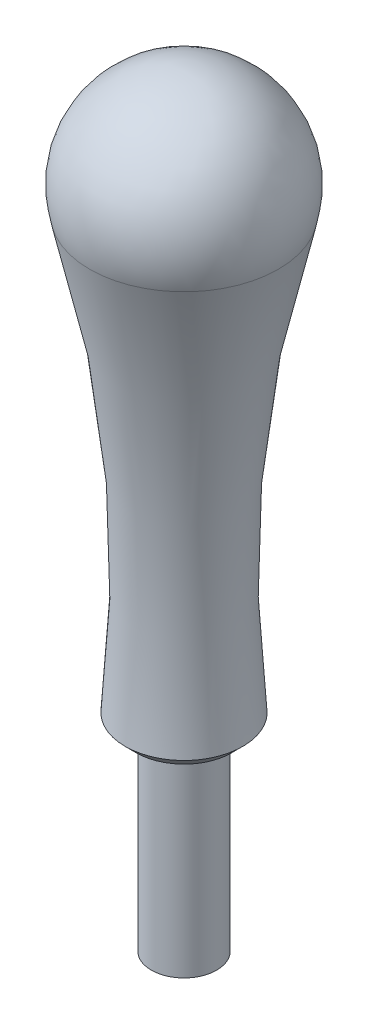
from build123d import *


with BuildPart() as part:
    # Sketch1 → Revolve1 (revolve)
    with BuildSketch(Plane.XY, mode=Mode.PRIVATE) as revolve1_sk:
        with BuildLine():
            Line((0, 0), (0, 116.656854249))
            ThreePointArc((0, 116.656854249), (-11.944253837, 110.730706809), (-14.450719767, 97.634827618))
            ThreePointArc((-14.450719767, 97.634827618), (-8.598093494, 64.904197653), (-9, 31.656854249))
            Line((-9, 31.656854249), (-7.343145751, 30))
            Line((-7.343145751, 30), (-5, 30))
            Line((-5, 30), (-5, 0))
            Line((-5, 0), (0, 0))
        make_face()
    revolve(revolve1_sk.sketch.rotate(Axis((0, 0, 0), (0, -1, 0)), 270), axis=Axis((0, 0, 0), (0, -1, 0)))


solid = part.part
